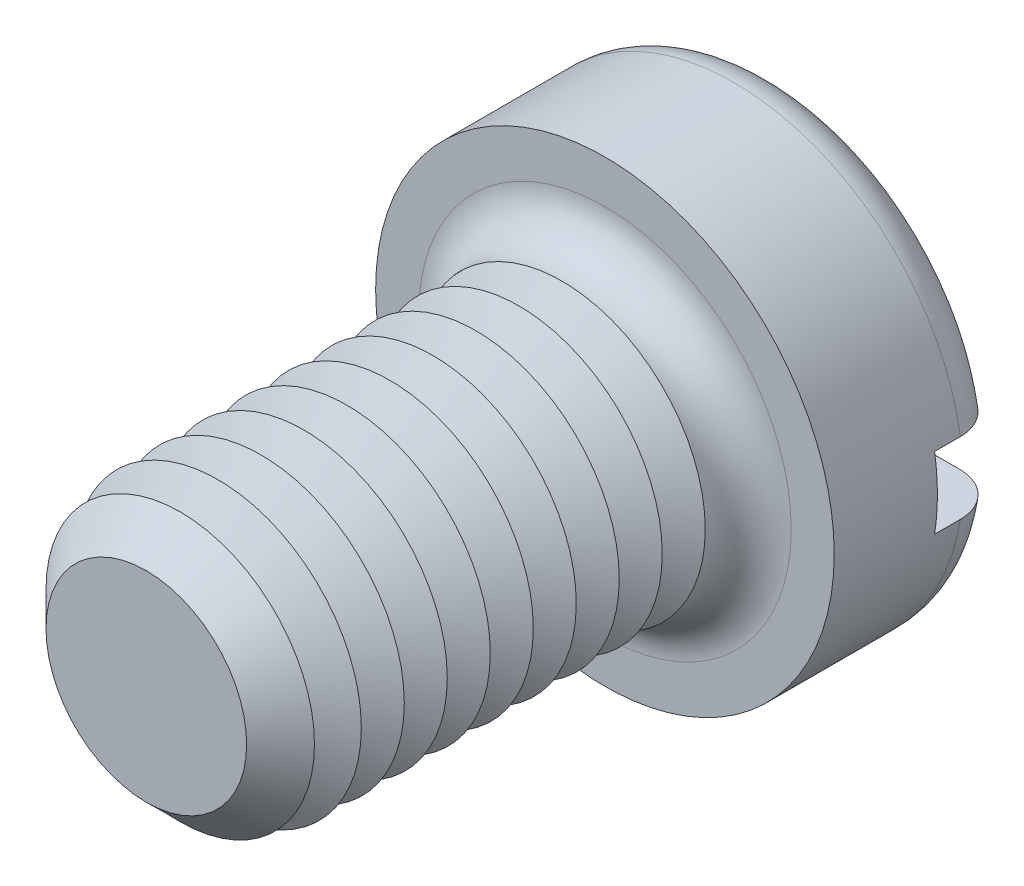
ISO-10303-21;
HEADER;
FILE_DESCRIPTION(('STEP AP214'),'2;1');
FILE_NAME('part.step','',(''),(''),'','','');
FILE_SCHEMA(('AUTOMOTIVE_DESIGN { 1 0 10303 214 1 1 1 1 }'));
ENDSEC;
DATA;
#1=APPLICATION_CONTEXT('core data for automotive mechanical design processes');
#2=APPLICATION_PROTOCOL_DEFINITION('international standard','automotive_design',2000,#1);
#3=PRODUCT_CONTEXT('',#1,'mechanical');
#4=PRODUCT('Part','Part','',(#3));
#5=PRODUCT_RELATED_PRODUCT_CATEGORY('part','',(#4));
#6=PRODUCT_DEFINITION_FORMATION('','',#4);
#7=PRODUCT_DEFINITION_CONTEXT('part definition',#1,'design');
#8=PRODUCT_DEFINITION('design','',#6,#7);
#9=PRODUCT_DEFINITION_SHAPE('','',#8);
#10=(LENGTH_UNIT() NAMED_UNIT(*) SI_UNIT(.MILLI.,.METRE.));
#11=(NAMED_UNIT(*) PLANE_ANGLE_UNIT() SI_UNIT($,.RADIAN.));
#12=(NAMED_UNIT(*) SI_UNIT($,.STERADIAN.) SOLID_ANGLE_UNIT());
#13=UNCERTAINTY_MEASURE_WITH_UNIT(LENGTH_MEASURE(1.E-05),#10,'distance_accuracy_value','');
#14=(GEOMETRIC_REPRESENTATION_CONTEXT(3) GLOBAL_UNCERTAINTY_ASSIGNED_CONTEXT((#13)) GLOBAL_UNIT_ASSIGNED_CONTEXT((#10,
#11,#12)) REPRESENTATION_CONTEXT('',''));
#15=CARTESIAN_POINT('',(0.,0.,0.));
#16=DIRECTION('',(0.,0.,1.));
#17=DIRECTION('',(1.,0.,0.));
#18=AXIS2_PLACEMENT_3D('',#15,#16,#17);
#19=CARTESIAN_POINT('',(0.,0.,-6.));
#20=DIRECTION('',(0.,0.,1.));
#21=DIRECTION('',(1.,0.,0.));
#22=AXIS2_PLACEMENT_3D('',#19,#20,#21);
#23=PLANE('',#22);
#24=CARTESIAN_POINT('',(0.,0.,-6.));
#25=DIRECTION('',(0.,0.,1.));
#26=DIRECTION('',(1.,0.,0.));
#27=AXIS2_PLACEMENT_3D('',#24,#25,#26);
#28=CIRCLE('',#27,6.5);
#29=CARTESIAN_POINT('',(-6.37867541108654,1.25,-6.));
#30=VERTEX_POINT('',#29);
#31=CARTESIAN_POINT('',(6.37867541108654,1.25,-6.));
#32=VERTEX_POINT('',#31);
#33=EDGE_CURVE('E116',#30,#32,#28,.F.);
#34=ORIENTED_EDGE('',*,*,#33,.T.);
#35=DIRECTION('',(1.,0.,0.));
#36=VECTOR('',#35,1.);
#37=CARTESIAN_POINT('',(-8.,1.25,-6.));
#38=LINE('',#37,#36);
#39=EDGE_CURVE('E111',#30,#32,#38,.T.);
#40=ORIENTED_EDGE('',*,*,#39,.F.);
#41=EDGE_LOOP('',(#34,#40));
#42=FACE_BOUND('',#41,.T.);
#43=ADVANCED_FACE('F39',(#42),#23,.F.);
#44=CARTESIAN_POINT('',(0.,0.,-4.5));
#45=DIRECTION('',(0.,0.,1.));
#46=DIRECTION('',(1.,0.,0.));
#47=AXIS2_PLACEMENT_3D('',#44,#45,#46);
#48=TOROIDAL_SURFACE('',#47,6.5,1.5);
#49=CARTESIAN_POINT('',(-7.63778128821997,1.25,-5.34492908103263));
#50=CARTESIAN_POINT('',(-7.58949199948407,1.25,-5.41482553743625));
#51=CARTESIAN_POINT('',(-7.53520056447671,1.25,-5.48065698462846));
#52=CARTESIAN_POINT('',(-7.41624971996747,1.25,-5.60228223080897));
#53=CARTESIAN_POINT('',(-7.35157642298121,1.25,-5.65806236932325));
#54=CARTESIAN_POINT('',(-7.21387612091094,1.25,-5.75795436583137));
#55=CARTESIAN_POINT('',(-7.14085828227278,1.25,-5.80207885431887));
#56=CARTESIAN_POINT('',(-6.98853766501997,1.25,-5.87758013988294));
#57=CARTESIAN_POINT('',(-6.90923642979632,1.25,-5.90896005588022));
#58=CARTESIAN_POINT('',(-6.74565677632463,1.25,-5.95849861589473));
#59=CARTESIAN_POINT('',(-6.66133328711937,1.25,-5.97650838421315));
#60=CARTESIAN_POINT('',(-6.49086565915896,1.25,-5.99833509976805));
#61=CARTESIAN_POINT('',(-6.40472129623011,1.25,-6.00215028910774));
#62=CARTESIAN_POINT('',(-6.23174891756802,1.25,-5.99550457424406));
#63=CARTESIAN_POINT('',(-6.14492874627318,1.25,-5.98483870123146));
#64=CARTESIAN_POINT('',(-5.97427268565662,1.25,-5.94920077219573));
#65=CARTESIAN_POINT('',(-5.89043699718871,1.25,-5.92422775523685));
#66=CARTESIAN_POINT('',(-5.72747580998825,1.25,-5.86041051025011));
#67=CARTESIAN_POINT('',(-5.64839123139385,1.25,-5.8214616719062));
#68=CARTESIAN_POINT('',(-5.49793182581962,1.25,-5.73076137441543));
#69=CARTESIAN_POINT('',(-5.42655700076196,1.25,-5.6790099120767));
#70=CARTESIAN_POINT('',(-5.29410028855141,1.25,-5.56444713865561));
#71=CARTESIAN_POINT('',(-5.23295591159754,1.25,-5.50170815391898));
#72=CARTESIAN_POINT('',(-5.12236155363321,1.25,-5.36664720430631));
#73=CARTESIAN_POINT('',(-5.07291010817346,1.25,-5.29432644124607));
#74=CARTESIAN_POINT('',(-4.98836421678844,1.25,-5.14389152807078));
#75=CARTESIAN_POINT('',(-4.95296843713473,1.25,-5.0659468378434));
#76=CARTESIAN_POINT('',(-4.89620356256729,1.25,-4.90510804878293));
#77=CARTESIAN_POINT('',(-4.87483169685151,1.25,-4.82221493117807));
#78=CARTESIAN_POINT('',(-4.8472995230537,1.25,-4.65636387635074));
#79=CARTESIAN_POINT('',(-4.84072446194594,1.25,-4.57347463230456));
#80=CARTESIAN_POINT('',(-4.84179430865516,1.25,-4.40779255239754));
#81=CARTESIAN_POINT('',(-4.84943782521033,1.25,-4.32499970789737));
#82=CARTESIAN_POINT('',(-4.87846819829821,1.25,-4.16301415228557));
#83=CARTESIAN_POINT('',(-4.89966978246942,1.25,-4.08378809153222));
#84=CARTESIAN_POINT('',(-4.95491528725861,1.25,-3.92995334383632));
#85=CARTESIAN_POINT('',(-4.98895983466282,1.25,-3.85534488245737));
#86=CARTESIAN_POINT('',(-5.06928242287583,1.25,-3.71183790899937));
#87=CARTESIAN_POINT('',(-5.11570495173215,1.25,-3.64302036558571));
#88=CARTESIAN_POINT('',(-5.21915370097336,1.25,-3.51388372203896));
#89=CARTESIAN_POINT('',(-5.27618132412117,1.25,-3.45356574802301));
#90=CARTESIAN_POINT('',(-5.40090076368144,1.25,-3.34137671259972));
#91=CARTESIAN_POINT('',(-5.46884305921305,1.25,-3.28978408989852));
#92=CARTESIAN_POINT('',(-5.61225757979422,1.25,-3.19841811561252));
#93=CARTESIAN_POINT('',(-5.68773079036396,1.25,-3.15864631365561));
#94=CARTESIAN_POINT('',(-5.84602026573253,1.25,-3.09111626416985));
#95=CARTESIAN_POINT('',(-5.92896901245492,1.25,-3.06366820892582));
#96=CARTESIAN_POINT('',(-6.09827849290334,1.25,-3.02294686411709));
#97=CARTESIAN_POINT('',(-6.18463944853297,1.25,-3.00967449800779));
#98=CARTESIAN_POINT('',(-6.35914138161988,1.25,-2.99765063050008));
#99=CARTESIAN_POINT('',(-6.4472913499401,1.25,-2.99902877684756));
#100=CARTESIAN_POINT('',(-6.62209547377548,1.25,-3.01665363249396));
#101=CARTESIAN_POINT('',(-6.70874965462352,1.25,-3.03290008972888));
#102=CARTESIAN_POINT('',(-6.87754008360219,1.25,-3.07975247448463));
#103=CARTESIAN_POINT('',(-6.95969991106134,1.25,-3.11027336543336));
#104=CARTESIAN_POINT('',(-7.11762200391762,1.25,-3.18486653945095));
#105=CARTESIAN_POINT('',(-7.19338469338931,1.25,-3.22893792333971));
#106=CARTESIAN_POINT('',(-7.33522754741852,1.25,-3.32873457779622));
#107=CARTESIAN_POINT('',(-7.40142768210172,1.25,-3.38428930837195));
#108=CARTESIAN_POINT('',(-7.52338344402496,1.25,-3.50587739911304));
#109=CARTESIAN_POINT('',(-7.5791399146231,1.25,-3.57190991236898));
#110=CARTESIAN_POINT('',(-7.67774856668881,1.25,-3.71151097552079));
#111=CARTESIAN_POINT('',(-7.72078137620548,1.25,-3.7849519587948));
#112=CARTESIAN_POINT('',(-7.79373860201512,1.25,-3.93807617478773));
#113=CARTESIAN_POINT('',(-7.82366445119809,1.25,-4.01775872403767));
#114=CARTESIAN_POINT('',(-7.86922494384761,1.25,-4.1801114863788));
#115=CARTESIAN_POINT('',(-7.88502105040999,1.25,-4.26273642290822));
#116=CARTESIAN_POINT('',(-7.90243332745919,1.25,-4.42948977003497));
#117=CARTESIAN_POINT('',(-7.90404643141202,1.25,-4.51361850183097));
#118=CARTESIAN_POINT('',(-7.89306914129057,1.25,-4.68049925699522));
#119=CARTESIAN_POINT('',(-7.88055163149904,1.25,-4.76325613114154));
#120=CARTESIAN_POINT('',(-7.84181179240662,1.25,-4.92542124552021));
#121=CARTESIAN_POINT('',(-7.81560657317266,1.25,-5.00483353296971));
#122=CARTESIAN_POINT('',(-7.76329893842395,1.25,-5.12766777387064));
#123=CARTESIAN_POINT('',(-7.74127773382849,1.25,-5.17287245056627));
#124=CARTESIAN_POINT('',(-7.69279783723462,1.25,-5.26083500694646));
#125=CARTESIAN_POINT('',(-7.66633917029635,1.25,-5.30359290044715));
#126=CARTESIAN_POINT('',(-7.63778128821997,1.25,-5.34492908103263));
#127=B_SPLINE_CURVE_WITH_KNOTS('',3,(#49,#50,#51,#52,#53,#54,#55,#56,#57,#58,#59,#60,#61,#62,
#63,#64,#65,#66,#67,#68,#69,#70,#71,#72,#73,#74,#75,#76,#77,#78,#79,#80,#81,#82,#83,#84,#85,#86,
#87,#88,#89,#90,#91,#92,#93,#94,#95,#96,#97,#98,#99,#100,#101,#102,#103,#104,#105,#106,#107,
#108,#109,#110,#111,#112,#113,#114,#115,#116,#117,#118,#119,#120,#121,#122,#123,#124,#125,#126),
.UNSPECIFIED.,.T.,.F.,(4,2,2,2,2,2,2,2,2,2,2,2,2,2,2,2,2,2,2,2,2,2,2,2,2,2,2,2,2,2,2,2,2,2,2,2,
2,2,4),(0.,0.254678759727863,0.509701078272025,0.764445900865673,1.01912834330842,
1.27660578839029,1.53411511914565,1.7953075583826,2.05651754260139,2.31972495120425,
2.58293242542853,2.84446831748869,3.10597143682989,3.36151874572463,3.61701554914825,
3.86525656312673,4.11347328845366,4.35836855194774,4.60327576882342,4.8511774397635,
5.0991119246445,5.35387584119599,5.60867314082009,5.86956650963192,6.13047687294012,
6.39369803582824,6.65691473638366,6.91858297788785,7.18023385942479,7.43824706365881,
7.69623942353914,7.95037087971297,8.20447454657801,8.45563599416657,8.70685174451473,
8.95677764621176,9.20639187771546,9.35700761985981,9.50762251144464),.UNSPECIFIED.);
#128=CARTESIAN_POINT('',(-7.90174031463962,1.25,-4.50000000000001));
#129=VERTEX_POINT('',#128);
#130=EDGE_CURVE('E257',#129,#30,#127,.T.);
#131=ORIENTED_EDGE('',*,*,#130,.F.);
#132=CARTESIAN_POINT('',(0.,0.,-4.5));
#133=DIRECTION('',(0.,0.,1.));
#134=DIRECTION('',(1.,0.,0.));
#135=AXIS2_PLACEMENT_3D('',#132,#133,#134);
#136=CIRCLE('',#135,8.);
#137=CARTESIAN_POINT('',(7.90174031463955,1.25,-4.5));
#138=VERTEX_POINT('',#137);
#139=EDGE_CURVE('E125',#138,#129,#136,.T.);
#140=ORIENTED_EDGE('',*,*,#139,.F.);
#141=CARTESIAN_POINT('',(4.95236709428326,1.25,-5.05808354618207));
#142=CARTESIAN_POINT('',(4.98477386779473,1.25,-5.13646278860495));
#143=CARTESIAN_POINT('',(5.02397623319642,1.25,-5.21210974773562));
#144=CARTESIAN_POINT('',(5.11464829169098,1.25,-5.35575180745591));
#145=CARTESIAN_POINT('',(5.16613670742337,1.25,-5.42373499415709));
#146=CARTESIAN_POINT('',(5.27963080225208,1.25,-5.55005899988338));
#147=CARTESIAN_POINT('',(5.34161871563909,1.25,-5.60841578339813));
#148=CARTESIAN_POINT('',(5.47431803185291,1.25,-5.71412381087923));
#149=CARTESIAN_POINT('',(5.545027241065,1.25,-5.76147781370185));
#150=CARTESIAN_POINT('',(5.69469818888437,1.25,-5.84486022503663));
#151=CARTESIAN_POINT('',(5.77379661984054,1.25,-5.88064336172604));
#152=CARTESIAN_POINT('',(5.93682776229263,1.25,-5.93863952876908));
#153=CARTESIAN_POINT('',(6.02076112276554,1.25,-5.96085073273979));
#154=CARTESIAN_POINT('',(6.19235911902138,1.25,-5.99130732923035));
#155=CARTESIAN_POINT('',(6.2800597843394,1.25,-5.99935025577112));
#156=CARTESIAN_POINT('',(6.45556807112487,1.25,-6.00057400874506));
#157=CARTESIAN_POINT('',(6.5433756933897,1.25,-5.99375472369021));
#158=CARTESIAN_POINT('',(6.71642471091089,1.25,-5.96539034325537));
#159=CARTESIAN_POINT('',(6.80167037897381,1.25,-5.94387137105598));
#160=CARTESIAN_POINT('',(6.96726399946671,1.25,-5.8866508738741));
#161=CARTESIAN_POINT('',(7.04761223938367,1.25,-5.85095018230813));
#162=CARTESIAN_POINT('',(7.2000703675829,1.25,-5.7668235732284));
#163=CARTESIAN_POINT('',(7.27226868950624,1.25,-5.71855796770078));
#164=CARTESIAN_POINT('',(7.40737382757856,1.25,-5.61041520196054));
#165=CARTESIAN_POINT('',(7.47028138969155,1.25,-5.55053897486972));
#166=CARTESIAN_POINT('',(7.5840004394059,1.25,-5.42185995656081));
#167=CARTESIAN_POINT('',(7.63498189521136,1.25,-5.35320736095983));
#168=CARTESIAN_POINT('',(7.72451646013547,1.25,-5.20822613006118));
#169=CARTESIAN_POINT('',(7.76307051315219,1.25,-5.13189807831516));
#170=CARTESIAN_POINT('',(7.82615156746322,1.25,-4.97479919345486));
#171=CARTESIAN_POINT('',(7.85085353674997,1.25,-4.89409858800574));
#172=CARTESIAN_POINT('',(7.88624162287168,1.25,-4.72968126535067));
#173=CARTESIAN_POINT('',(7.89692844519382,1.25,-4.64596470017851));
#174=CARTESIAN_POINT('',(7.90393395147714,1.25,-4.47857496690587));
#175=CARTESIAN_POINT('',(7.900361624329,1.25,-4.39490633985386));
#176=CARTESIAN_POINT('',(7.8792027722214,1.25,-4.2293620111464));
#177=CARTESIAN_POINT('',(7.86161649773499,1.25,-4.14748627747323));
#178=CARTESIAN_POINT('',(7.81298565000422,1.25,-3.98793539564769));
#179=CARTESIAN_POINT('',(7.78195585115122,1.25,-3.91025574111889));
#180=CARTESIAN_POINT('',(7.70736418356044,1.25,-3.76116938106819));
#181=CARTESIAN_POINT('',(7.66380211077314,1.25,-3.68976277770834));
#182=CARTESIAN_POINT('',(7.56515173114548,1.25,-3.55480889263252));
#183=CARTESIAN_POINT('',(7.51000119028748,1.25,-3.49130712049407));
#184=CARTESIAN_POINT('',(7.38992820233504,1.25,-3.3743390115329));
#185=CARTESIAN_POINT('',(7.32500529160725,1.25,-3.32087315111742));
#186=CARTESIAN_POINT('',(7.18646521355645,1.25,-3.22483712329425));
#187=CARTESIAN_POINT('',(7.11275872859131,1.25,-3.18239583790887));
#188=CARTESIAN_POINT('',(6.95934489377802,1.25,-3.11028530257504));
#189=CARTESIAN_POINT('',(6.87963710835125,1.25,-3.08061698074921));
#190=CARTESIAN_POINT('',(6.71523243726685,1.25,-3.03442872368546));
#191=CARTESIAN_POINT('',(6.63047940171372,1.25,-3.0181086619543));
#192=CARTESIAN_POINT('',(6.45944163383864,1.25,-2.99971307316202));
#193=CARTESIAN_POINT('',(6.37315677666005,1.25,-2.99763871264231));
#194=CARTESIAN_POINT('',(6.20021063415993,1.25,-3.00779604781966));
#195=CARTESIAN_POINT('',(6.11356117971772,1.25,-3.02022976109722));
#196=CARTESIAN_POINT('',(5.9435409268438,1.25,-3.0593597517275));
#197=CARTESIAN_POINT('',(5.86017035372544,1.25,-3.08605700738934));
#198=CARTESIAN_POINT('',(5.69848536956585,1.25,-3.15322746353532));
#199=CARTESIAN_POINT('',(5.62021039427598,1.25,-3.1937956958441));
#200=CARTESIAN_POINT('',(5.47164170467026,1.25,-3.28758816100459));
#201=CARTESIAN_POINT('',(5.40134797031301,1.25,-3.3408123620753));
#202=CARTESIAN_POINT('',(5.27136483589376,1.25,-3.45806317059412));
#203=CARTESIAN_POINT('',(5.21160120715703,1.25,-3.5220074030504));
#204=CARTESIAN_POINT('',(5.10396941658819,1.25,-3.65922833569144));
#205=CARTESIAN_POINT('',(5.05609917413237,1.25,-3.73250340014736));
#206=CARTESIAN_POINT('',(4.97487058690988,1.25,-3.8844714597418));
#207=CARTESIAN_POINT('',(4.94119529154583,1.25,-3.96299495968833));
#208=CARTESIAN_POINT('',(4.88793322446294,1.25,-4.12470694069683));
#209=CARTESIAN_POINT('',(4.86834741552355,1.25,-4.20789574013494));
#210=CARTESIAN_POINT('',(4.84433446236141,1.25,-4.3740749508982));
#211=CARTESIAN_POINT('',(4.83950391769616,1.25,-4.45700748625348));
#212=CARTESIAN_POINT('',(4.84404021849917,1.25,-4.62240731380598));
#213=CARTESIAN_POINT('',(4.85338770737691,1.25,-4.70487508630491));
#214=CARTESIAN_POINT('',(4.87895619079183,1.25,-4.83246978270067));
#215=CARTESIAN_POINT('',(4.89056704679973,1.25,-4.87856970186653));
#216=CARTESIAN_POINT('',(4.91819711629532,1.25,-4.96942661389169));
#217=CARTESIAN_POINT('',(4.93421619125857,1.25,-5.01418364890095));
#218=CARTESIAN_POINT('',(4.95236709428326,1.25,-5.05808354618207));
#219=B_SPLINE_CURVE_WITH_KNOTS('',3,(#141,#142,#143,#144,#145,#146,#147,#148,#149,#150,#151,
#152,#153,#154,#155,#156,#157,#158,#159,#160,#161,#162,#163,#164,#165,#166,#167,#168,#169,#170,
#171,#172,#173,#174,#175,#176,#177,#178,#179,#180,#181,#182,#183,#184,#185,#186,#187,#188,#189,
#190,#191,#192,#193,#194,#195,#196,#197,#198,#199,#200,#201,#202,#203,#204,#205,#206,#207,#208,
#209,#210,#211,#212,#213,#214,#215,#216,#217,#218),.UNSPECIFIED.,.T.,.F.,(4,2,2,2,2,2,2,2,2,2,2,
2,2,2,2,2,2,2,2,2,2,2,2,2,2,2,2,2,2,2,2,2,2,2,2,2,2,2,4),(0.,0.254263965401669,
0.508917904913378,0.763145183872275,1.01730864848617,1.27655188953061,1.53583000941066,
1.79878406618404,2.06174009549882,2.32423003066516,2.5867045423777,2.84598168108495,
3.10523799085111,3.36053725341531,3.61581712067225,3.86779535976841,4.11976091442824,
4.36980428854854,4.61984319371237,4.86960800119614,5.11937687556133,5.3705230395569,
5.62168112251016,5.87565515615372,6.12964764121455,6.38737709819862,6.64512765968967,
6.90651052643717,7.16791132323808,7.43114013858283,7.69436829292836,7.95565940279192,
8.21690477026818,8.47196060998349,8.72703387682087,8.97506819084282,9.22276418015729,
9.36518087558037,9.50759309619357),.UNSPECIFIED.);
#220=EDGE_CURVE('E259',#32,#138,#219,.T.);
#221=ORIENTED_EDGE('',*,*,#220,.F.);
#222=ORIENTED_EDGE('',*,*,#33,.F.);
#223=EDGE_LOOP('',(#131,#140,#221,#222));
#224=FACE_BOUND('',#223,.T.);
#225=ADVANCED_FACE('F241',(#224),#48,.T.);
#226=CARTESIAN_POINT('',(0.,0.,-6.));
#227=DIRECTION('',(0.,0.,1.));
#228=DIRECTION('',(1.,0.,0.));
#229=AXIS2_PLACEMENT_3D('',#226,#227,#228);
#230=CYLINDRICAL_SURFACE('',#229,8.);
#231=DIRECTION('',(0.,0.,1.));
#232=VECTOR('',#231,1.);
#233=CARTESIAN_POINT('',(7.90174031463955,1.25,-6.));
#234=LINE('',#233,#232);
#235=CARTESIAN_POINT('',(7.90174031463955,1.25,-3.6));
#236=VERTEX_POINT('',#235);
#237=EDGE_CURVE('E272',#138,#236,#234,.T.);
#238=ORIENTED_EDGE('',*,*,#237,.F.);
#239=ORIENTED_EDGE('',*,*,#139,.T.);
#240=DIRECTION('',(0.,0.,1.));
#241=VECTOR('',#240,1.);
#242=CARTESIAN_POINT('',(-7.90174031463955,1.25,-6.));
#243=LINE('',#242,#241);
#244=CARTESIAN_POINT('',(-7.90174031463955,1.25,-3.6));
#245=VERTEX_POINT('',#244);
#246=EDGE_CURVE('E63',#245,#129,#243,.F.);
#247=ORIENTED_EDGE('',*,*,#246,.F.);
#248=CARTESIAN_POINT('',(0.,0.,-3.6));
#249=DIRECTION('',(0.,0.,-1.));
#250=DIRECTION('',(-1.,0.,0.));
#251=AXIS2_PLACEMENT_3D('',#248,#249,#250);
#252=CIRCLE('',#251,8.);
#253=CARTESIAN_POINT('',(-7.90174031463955,-1.25,-3.6));
#254=VERTEX_POINT('',#253);
#255=EDGE_CURVE('E43',#245,#254,#252,.F.);
#256=ORIENTED_EDGE('',*,*,#255,.T.);
#257=DIRECTION('',(0.,0.,1.));
#258=VECTOR('',#257,1.);
#259=CARTESIAN_POINT('',(-7.90174031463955,-1.25,-6.));
#260=LINE('',#259,#258);
#261=CARTESIAN_POINT('',(-7.9017403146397,-1.25,-4.49999999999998));
#262=VERTEX_POINT('',#261);
#263=EDGE_CURVE('E269',#262,#254,#260,.T.);
#264=ORIENTED_EDGE('',*,*,#263,.F.);
#265=CARTESIAN_POINT('',(7.90174031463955,-1.25,-4.5));
#266=VERTEX_POINT('',#265);
#267=EDGE_CURVE('E127',#262,#266,#136,.T.);
#268=ORIENTED_EDGE('',*,*,#267,.T.);
#269=DIRECTION('',(0.,0.,1.));
#270=VECTOR('',#269,1.);
#271=CARTESIAN_POINT('',(7.90174031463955,-1.25,-6.));
#272=LINE('',#271,#270);
#273=CARTESIAN_POINT('',(7.90174031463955,-1.25,-3.6));
#274=VERTEX_POINT('',#273);
#275=EDGE_CURVE('E55',#274,#266,#272,.F.);
#276=ORIENTED_EDGE('',*,*,#275,.F.);
#277=EDGE_CURVE('E11',#274,#236,#252,.F.);
#278=ORIENTED_EDGE('',*,*,#277,.T.);
#279=EDGE_LOOP('',(#238,#239,#247,#256,#264,#268,#276,#278));
#280=FACE_BOUND('',#279,.T.);
#281=CARTESIAN_POINT('',(0.,0.,0.));
#282=DIRECTION('',(0.,0.,1.));
#283=DIRECTION('',(1.,0.,0.));
#284=AXIS2_PLACEMENT_3D('',#281,#282,#283);
#285=CIRCLE('',#284,8.);
#286=CARTESIAN_POINT('',(8.,0.,0.));
#287=VERTEX_POINT('',#286);
#288=EDGE_CURVE('E275',#287,#287,#285,.T.);
#289=ORIENTED_EDGE('',*,*,#288,.F.);
#290=EDGE_LOOP('',(#289));
#291=FACE_BOUND('',#290,.T.);
#292=ADVANCED_FACE('F237',(#280,#291),#230,.T.);
#293=CARTESIAN_POINT('',(6.37867541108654,-1.25,-6.));
#294=VERTEX_POINT('',#293);
#295=CARTESIAN_POINT('',(-6.37867541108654,-1.25,-6.));
#296=VERTEX_POINT('',#295);
#297=EDGE_CURVE('E109',#294,#296,#28,.F.);
#298=ORIENTED_EDGE('',*,*,#297,.T.);
#299=DIRECTION('',(-1.,0.,0.));
#300=VECTOR('',#299,1.);
#301=CARTESIAN_POINT('',(-8.,-1.25,-6.));
#302=LINE('',#301,#300);
#303=EDGE_CURVE('E96',#294,#296,#302,.T.);
#304=ORIENTED_EDGE('',*,*,#303,.F.);
#305=EDGE_LOOP('',(#298,#304));
#306=FACE_BOUND('',#305,.T.);
#307=ADVANCED_FACE('F108',(#306),#23,.F.);
#308=CARTESIAN_POINT('',(0.,0.,0.));
#309=DIRECTION('',(0.,0.,1.));
#310=DIRECTION('',(1.,0.,0.));
#311=AXIS2_PLACEMENT_3D('',#308,#309,#310);
#312=PLANE('',#311);
#313=CARTESIAN_POINT('',(0.,0.,0.));
#314=DIRECTION('',(0.,0.,1.));
#315=DIRECTION('',(1.,0.,0.));
#316=AXIS2_PLACEMENT_3D('',#313,#314,#315);
#317=CIRCLE('',#316,6.5);
#318=CARTESIAN_POINT('',(6.5,0.,0.));
#319=VERTEX_POINT('',#318);
#320=EDGE_CURVE('E115',#319,#319,#317,.F.);
#321=ORIENTED_EDGE('',*,*,#320,.T.);
#322=EDGE_LOOP('',(#321));
#323=FACE_BOUND('',#322,.T.);
#324=ORIENTED_EDGE('',*,*,#288,.T.);
#325=EDGE_LOOP('',(#324));
#326=FACE_BOUND('',#325,.T.);
#327=ADVANCED_FACE('F236',(#323,#326),#312,.T.);
#328=CARTESIAN_POINT('',(-7.63778128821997,-1.25,-5.34492908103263));
#329=CARTESIAN_POINT('',(-7.68527581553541,-1.25,-5.27616964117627));
#330=CARTESIAN_POINT('',(-7.72703224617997,-1.25,-5.20337764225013));
#331=CARTESIAN_POINT('',(-7.79778035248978,-1.25,-5.05176511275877));
#332=CARTESIAN_POINT('',(-7.82675823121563,-1.25,-4.97293817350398));
#333=CARTESIAN_POINT('',(-7.87103239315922,-1.25,-4.81153865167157));
#334=CARTESIAN_POINT('',(-7.8863313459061,-1.25,-4.72896680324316));
#335=CARTESIAN_POINT('',(-7.90278562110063,-1.25,-4.56244566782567));
#336=CARTESIAN_POINT('',(-7.90394420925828,-1.25,-4.4784967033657));
#337=CARTESIAN_POINT('',(-7.89211470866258,-1.25,-4.31190980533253));
#338=CARTESIAN_POINT('',(-7.87917806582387,-1.25,-4.22926821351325));
#339=CARTESIAN_POINT('',(-7.8396278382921,-1.25,-4.06732477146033));
#340=CARTESIAN_POINT('',(-7.81301388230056,-1.25,-3.98802301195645));
#341=CARTESIAN_POINT('',(-7.74686575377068,-1.25,-3.83490116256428));
#342=CARTESIAN_POINT('',(-7.70731700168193,-1.25,-3.76108737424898));
#343=CARTESIAN_POINT('',(-7.61647675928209,-1.25,-3.62108231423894));
#344=CARTESIAN_POINT('',(-7.56518496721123,-1.25,-3.55489123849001));
#345=CARTESIAN_POINT('',(-7.45192141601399,-1.25,-3.43145488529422));
#346=CARTESIAN_POINT('',(-7.3898717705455,-1.25,-3.37428109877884));
#347=CARTESIAN_POINT('',(-7.25715883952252,-1.25,-3.27100737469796));
#348=CARTESIAN_POINT('',(-7.18649507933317,-1.25,-3.22490804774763));
#349=CARTESIAN_POINT('',(-7.03760898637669,-1.25,-3.14445316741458));
#350=CARTESIAN_POINT('',(-6.95930204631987,-1.25,-3.1102542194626));
#351=CARTESIAN_POINT('',(-6.79811453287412,-1.25,-3.05526915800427));
#352=CARTESIAN_POINT('',(-6.71523359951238,-1.25,-3.03448410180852));
#353=CARTESIAN_POINT('',(-6.5459165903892,-1.25,-3.006592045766));
#354=CARTESIAN_POINT('',(-6.45944575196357,-1.25,-2.99969602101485));
#355=CARTESIAN_POINT('',(-6.28655568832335,-1.25,-3.00032465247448));
#356=CARTESIAN_POINT('',(-6.20013646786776,-1.25,-3.00785047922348));
#357=CARTESIAN_POINT('',(-6.02865505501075,-1.25,-3.03725742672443));
#358=CARTESIAN_POINT('',(-5.94362352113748,-1.25,-3.05931758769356));
#359=CARTESIAN_POINT('',(-5.77844448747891,-1.25,-3.11735373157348));
#360=CARTESIAN_POINT('',(-5.69829723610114,-1.25,-3.15333042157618));
#361=CARTESIAN_POINT('',(-5.54495924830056,-1.25,-3.23837037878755));
#362=CARTESIAN_POINT('',(-5.47178958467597,-1.25,-3.28747168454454));
#363=CARTESIAN_POINT('',(-5.33486536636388,-1.25,-3.39741183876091));
#364=CARTESIAN_POINT('',(-5.27111040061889,-1.25,-3.45825017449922));
#365=CARTESIAN_POINT('',(-5.15579778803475,-1.25,-3.5891472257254));
#366=CARTESIAN_POINT('',(-5.10409113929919,-1.25,-3.65907455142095));
#367=CARTESIAN_POINT('',(-5.01353659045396,-1.25,-3.8068142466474));
#368=CARTESIAN_POINT('',(-4.97468647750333,-1.25,-3.88462525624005));
#369=CARTESIAN_POINT('',(-4.91208858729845,-1.25,-4.04366636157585));
#370=CARTESIAN_POINT('',(-4.88795969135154,-1.25,-4.12474643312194));
#371=CARTESIAN_POINT('',(-4.85404909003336,-1.25,-4.28985038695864));
#372=CARTESIAN_POINT('',(-4.84426486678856,-1.25,-4.37387374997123));
#373=CARTESIAN_POINT('',(-4.83946276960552,-1.25,-4.54023897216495));
#374=CARTESIAN_POINT('',(-4.8440833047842,-1.25,-4.62257060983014));
#375=CARTESIAN_POINT('',(-4.86713763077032,-1.25,-4.78527148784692));
#376=CARTESIAN_POINT('',(-4.88557092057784,-1.25,-4.86564079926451));
#377=CARTESIAN_POINT('',(-4.9355229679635,-1.25,-5.02189555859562));
#378=CARTESIAN_POINT('',(-4.9669975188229,-1.25,-5.09779517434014));
#379=CARTESIAN_POINT('',(-5.04199393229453,-1.25,-5.24338322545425));
#380=CARTESIAN_POINT('',(-5.0855168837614,-1.25,-5.31307109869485));
#381=CARTESIAN_POINT('',(-5.1842754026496,-1.25,-5.44580979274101));
#382=CARTESIAN_POINT('',(-5.2397318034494,-1.25,-5.50869620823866));
#383=CARTESIAN_POINT('',(-5.36015301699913,-1.25,-5.62458635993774));
#384=CARTESIAN_POINT('',(-5.42511919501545,-1.25,-5.67758867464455));
#385=CARTESIAN_POINT('',(-5.56469412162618,-1.25,-5.7737610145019));
#386=CARTESIAN_POINT('',(-5.6395232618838,-1.25,-5.81661133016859));
#387=CARTESIAN_POINT('',(-5.79521544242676,-1.25,-5.8894110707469));
#388=CARTESIAN_POINT('',(-5.87607915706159,-1.25,-5.91935905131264));
#389=CARTESIAN_POINT('',(-6.04317815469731,-1.25,-5.9660059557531));
#390=CARTESIAN_POINT('',(-6.12948555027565,-1.25,-5.98244700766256));
#391=CARTESIAN_POINT('',(-6.30363462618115,-1.25,-6.00064866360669));
#392=CARTESIAN_POINT('',(-6.39147629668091,-1.25,-6.00240936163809));
#393=CARTESIAN_POINT('',(-6.5664192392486,-1.25,-5.9911248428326));
#394=CARTESIAN_POINT('',(-6.653518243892,-1.25,-5.9780442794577));
#395=CARTESIAN_POINT('',(-6.82426167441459,-1.25,-5.93729204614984));
#396=CARTESIAN_POINT('',(-6.90790538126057,-1.25,-5.90961735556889));
#397=CARTESIAN_POINT('',(-7.06846412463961,-1.25,-5.84071272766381));
#398=CARTESIAN_POINT('',(-7.14543542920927,-1.25,-5.79961377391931));
#399=CARTESIAN_POINT('',(-7.29116896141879,-1.25,-5.70491210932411));
#400=CARTESIAN_POINT('',(-7.35994165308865,-1.25,-5.65132560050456));
#401=CARTESIAN_POINT('',(-7.46362894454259,-1.25,-5.55509815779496));
#402=CARTESIAN_POINT('',(-7.50165191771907,-1.25,-5.51575032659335));
#403=CARTESIAN_POINT('',(-7.57319530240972,-1.25,-5.43315308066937));
#404=CARTESIAN_POINT('',(-7.60671575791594,-1.25,-5.38990370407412));
#405=CARTESIAN_POINT('',(-7.63778128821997,-1.25,-5.34492908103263));
#406=B_SPLINE_CURVE_WITH_KNOTS('',3,(#328,#329,#330,#331,#332,#333,#334,#335,#336,#337,#338,
#339,#340,#341,#342,#343,#344,#345,#346,#347,#348,#349,#350,#351,#352,#353,#354,#355,#356,#357,
#358,#359,#360,#361,#362,#363,#364,#365,#366,#367,#368,#369,#370,#371,#372,#373,#374,#375,#376,
#377,#378,#379,#380,#381,#382,#383,#384,#385,#386,#387,#388,#389,#390,#391,#392,#393,#394,#395,
#396,#397,#398,#399,#400,#401,#402,#403,#404,#405),.UNSPECIFIED.,.T.,.F.,(4,2,2,2,2,2,2,2,2,2,2,
2,2,2,2,2,2,2,2,2,2,2,2,2,2,2,2,2,2,2,2,2,2,2,2,2,2,2,4),(0.,0.250506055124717,
0.501281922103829,0.752008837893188,1.00267784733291,1.25243500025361,1.50219893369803,
1.75224536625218,2.00229822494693,2.25424343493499,2.50620253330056,2.76136198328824,
3.01654154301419,3.27556891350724,3.53461730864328,3.79691797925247,4.05923197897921,
4.32231463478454,4.5853858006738,4.84500678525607,5.10458306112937,5.3571172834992,
5.60960717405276,5.85581050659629,6.1020049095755,6.34737151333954,6.59276029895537,
6.84315522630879,7.09358613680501,7.35108485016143,7.60861238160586,7.87094926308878,
8.13328446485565,8.39624576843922,8.65926152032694,8.91978401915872,9.17997036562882,
9.34382460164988,9.50767723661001),.UNSPECIFIED.);
#407=EDGE_CURVE('E103',#296,#262,#406,.T.);
#408=ORIENTED_EDGE('',*,*,#407,.F.);
#409=ORIENTED_EDGE('',*,*,#297,.F.);
#410=CARTESIAN_POINT('',(4.95236709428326,-1.25,-5.05808354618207));
#411=CARTESIAN_POINT('',(4.92105512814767,-1.25,-4.98233216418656));
#412=CARTESIAN_POINT('',(4.89604361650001,-1.25,-4.90392040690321));
#413=CARTESIAN_POINT('',(4.85951223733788,-1.25,-4.74395758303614));
#414=CARTESIAN_POINT('',(4.8480045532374,-1.25,-4.66240375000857));
#415=CARTESIAN_POINT('',(4.83891469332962,-1.25,-4.49852199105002));
#416=CARTESIAN_POINT('',(4.84133145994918,-1.25,-4.41619412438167));
#417=CARTESIAN_POINT('',(4.8600038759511,-1.25,-4.25314313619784));
#418=CARTESIAN_POINT('',(4.87625705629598,-1.25,-4.17241973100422));
#419=CARTESIAN_POINT('',(4.92196554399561,-1.25,-4.01505032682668));
#420=CARTESIAN_POINT('',(4.95138456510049,-1.25,-3.93839376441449));
#421=CARTESIAN_POINT('',(5.02244158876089,-1.25,-3.79097367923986));
#422=CARTESIAN_POINT('',(5.06408092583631,-1.25,-3.72021080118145));
#423=CARTESIAN_POINT('',(5.15918188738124,-1.25,-3.5851203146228));
#424=CARTESIAN_POINT('',(5.21285223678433,-1.25,-3.5209397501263));
#425=CARTESIAN_POINT('',(5.32993512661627,-1.25,-3.40218700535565));
#426=CARTESIAN_POINT('',(5.39334903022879,-1.25,-3.34761617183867));
#427=CARTESIAN_POINT('',(5.5300552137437,-1.25,-3.24801679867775));
#428=CARTESIAN_POINT('',(5.60357647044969,-1.25,-3.20330242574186));
#429=CARTESIAN_POINT('',(5.75697062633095,-1.25,-3.1265687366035));
#430=CARTESIAN_POINT('',(5.83684424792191,-1.25,-3.09455086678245));
#431=CARTESIAN_POINT('',(6.00239031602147,-1.25,-3.04353393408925));
#432=CARTESIAN_POINT('',(6.08814636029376,-1.25,-3.02480570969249));
#433=CARTESIAN_POINT('',(6.26158564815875,-1.25,-3.00194915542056));
#434=CARTESIAN_POINT('',(6.34926896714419,-1.25,-2.997821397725));
#435=CARTESIAN_POINT('',(6.52441816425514,-1.25,-3.00435236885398));
#436=CARTESIAN_POINT('',(6.61188199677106,-1.25,-3.01506655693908));
#437=CARTESIAN_POINT('',(6.78373130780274,-1.25,-3.05116556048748));
#438=CARTESIAN_POINT('',(6.8681168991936,-1.25,-3.07654983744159));
#439=CARTESIAN_POINT('',(7.03056473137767,-1.25,-3.14105639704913));
#440=CARTESIAN_POINT('',(7.10867812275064,-1.25,-3.18004978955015));
#441=CARTESIAN_POINT('',(7.25711285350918,-1.25,-3.27078804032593));
#442=CARTESIAN_POINT('',(7.327434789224,-1.25,-3.32253192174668));
#443=CARTESIAN_POINT('',(7.45716954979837,-1.25,-3.4364775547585));
#444=CARTESIAN_POINT('',(7.51672925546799,-1.25,-3.49851206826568));
#445=CARTESIAN_POINT('',(7.62440498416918,-1.25,-3.63182557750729));
#446=CARTESIAN_POINT('',(7.67252193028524,-1.25,-3.70310382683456));
#447=CARTESIAN_POINT('',(7.75523498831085,-1.25,-3.8517825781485));
#448=CARTESIAN_POINT('',(7.79001407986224,-1.25,-3.92908131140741));
#449=CARTESIAN_POINT('',(7.84595474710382,-1.25,-4.08845836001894));
#450=CARTESIAN_POINT('',(7.86711715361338,-1.25,-4.1705363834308));
#451=CARTESIAN_POINT('',(7.89503817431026,-1.25,-4.33627683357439));
#452=CARTESIAN_POINT('',(7.90193595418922,-1.25,-4.41991584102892));
#453=CARTESIAN_POINT('',(7.90153623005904,-1.25,-4.58715860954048));
#454=CARTESIAN_POINT('',(7.89423915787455,-1.25,-4.67076237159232));
#455=CARTESIAN_POINT('',(7.86572271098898,-1.25,-4.83525080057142));
#456=CARTESIAN_POINT('',(7.84455307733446,-1.25,-4.91614410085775));
#457=CARTESIAN_POINT('',(7.78897430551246,-1.25,-5.0732444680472));
#458=CARTESIAN_POINT('',(7.75456511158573,-1.25,-5.1494515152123));
#459=CARTESIAN_POINT('',(7.67339923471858,-1.25,-5.29528903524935));
#460=CARTESIAN_POINT('',(7.62660424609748,-1.25,-5.36489817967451));
#461=CARTESIAN_POINT('',(7.52209201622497,-1.25,-5.49536318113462));
#462=CARTESIAN_POINT('',(7.4643743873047,-1.25,-5.55621872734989));
#463=CARTESIAN_POINT('',(7.33909994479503,-1.25,-5.66807257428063));
#464=CARTESIAN_POINT('',(7.27145672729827,-1.25,-5.71897407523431));
#465=CARTESIAN_POINT('',(7.12868060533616,-1.25,-5.80887807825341));
#466=CARTESIAN_POINT('',(7.0535472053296,-1.25,-5.84787979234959));
#467=CARTESIAN_POINT('',(6.89682225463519,-1.25,-5.91345911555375));
#468=CARTESIAN_POINT('',(6.81515596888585,-1.25,-5.93985808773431));
#469=CARTESIAN_POINT('',(6.64858434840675,-1.25,-5.97879449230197));
#470=CARTESIAN_POINT('',(6.56367874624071,-1.25,-5.99133077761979));
#471=CARTESIAN_POINT('',(6.39168259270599,-1.25,-6.00236627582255));
#472=CARTESIAN_POINT('',(6.30457835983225,-1.25,-6.00065255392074));
#473=CARTESIAN_POINT('',(6.13186422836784,-1.25,-5.98278857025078));
#474=CARTESIAN_POINT('',(6.04625438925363,-1.25,-5.96663773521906));
#475=CARTESIAN_POINT('',(5.87802521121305,-1.25,-5.92012173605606));
#476=CARTESIAN_POINT('',(5.79544617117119,-1.25,-5.88961066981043));
#477=CARTESIAN_POINT('',(5.63656223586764,-1.25,-5.81513349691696));
#478=CARTESIAN_POINT('',(5.56025908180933,-1.25,-5.77116367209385));
#479=CARTESIAN_POINT('',(5.4162607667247,-1.25,-5.67098882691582));
#480=CARTESIAN_POINT('',(5.34855795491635,-1.25,-5.61479480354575));
#481=CARTESIAN_POINT('',(5.22382615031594,-1.25,-5.49168804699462));
#482=CARTESIAN_POINT('',(5.16678340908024,-1.25,-5.42478932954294));
#483=CARTESIAN_POINT('',(5.08326589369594,-1.25,-5.3075481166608));
#484=CARTESIAN_POINT('',(5.05313168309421,-1.25,-5.25976959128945));
#485=CARTESIAN_POINT('',(4.99845900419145,-1.25,-5.16110869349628));
#486=CARTESIAN_POINT('',(4.9739204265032,-1.25,-5.11022638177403));
#487=CARTESIAN_POINT('',(4.95236709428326,-1.25,-5.05808354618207));
#488=B_SPLINE_CURVE_WITH_KNOTS('',3,(#410,#411,#412,#413,#414,#415,#416,#417,#418,#419,#420,
#421,#422,#423,#424,#425,#426,#427,#428,#429,#430,#431,#432,#433,#434,#435,#436,#437,#438,#439,
#440,#441,#442,#443,#444,#445,#446,#447,#448,#449,#450,#451,#452,#453,#454,#455,#456,#457,#458,
#459,#460,#461,#462,#463,#464,#465,#466,#467,#468,#469,#470,#471,#472,#473,#474,#475,#476,#477,
#478,#479,#480,#481,#482,#483,#484,#485,#486,#487),.UNSPECIFIED.,.T.,.F.,(4,2,2,2,2,2,2,2,2,2,2,
2,2,2,2,2,2,2,2,2,2,2,2,2,2,2,2,2,2,2,2,2,2,2,2,2,2,2,4),(0.,0.245701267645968,
0.491624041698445,0.737528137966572,0.983388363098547,1.22857510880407,1.47378864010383,
1.72364048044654,1.97352730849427,2.2304941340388,2.48749022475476,2.74958408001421,
3.01168820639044,3.27477437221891,3.53785088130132,3.79850056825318,4.05913029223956,
4.31587819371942,4.57260537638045,4.82567253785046,5.07872425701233,5.32929532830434,
5.57985877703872,5.8295286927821,6.07919966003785,6.32965199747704,6.58011322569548,
6.8329006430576,7.08570479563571,7.3419930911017,7.59830259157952,7.85844887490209,
8.11860548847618,8.38146435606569,8.64439590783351,8.90709189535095,9.16944670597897,
9.33857644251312,9.5077028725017),.UNSPECIFIED.);
#489=EDGE_CURVE('E92',#266,#294,#488,.T.);
#490=ORIENTED_EDGE('',*,*,#489,.F.);
#491=ORIENTED_EDGE('',*,*,#267,.F.);
#492=EDGE_LOOP('',(#408,#409,#490,#491));
#493=FACE_BOUND('',#492,.T.);
#494=ADVANCED_FACE('F113',(#493),#48,.T.);
#495=CARTESIAN_POINT('',(0.,0.,1.5));
#496=DIRECTION('',(0.,0.,1.));
#497=DIRECTION('',(1.,0.,0.));
#498=AXIS2_PLACEMENT_3D('',#495,#496,#497);
#499=TOROIDAL_SURFACE('',#498,6.5,1.5);
#500=ORIENTED_EDGE('',*,*,#320,.F.);
#501=EDGE_LOOP('',(#500));
#502=FACE_BOUND('',#501,.T.);
#503=CARTESIAN_POINT('',(0.,0.,1.5));
#504=DIRECTION('',(0.,0.,-1.));
#505=DIRECTION('',(-1.,0.,0.));
#506=AXIS2_PLACEMENT_3D('',#503,#504,#505);
#507=CIRCLE('',#506,5.);
#508=CARTESIAN_POINT('',(-5.,0.,1.5));
#509=VERTEX_POINT('',#508);
#510=EDGE_CURVE('E280',#509,#509,#507,.T.);
#511=ORIENTED_EDGE('',*,*,#510,.T.);
#512=EDGE_LOOP('',(#511));
#513=FACE_BOUND('',#512,.T.);
#514=ADVANCED_FACE('F229',(#502,#513),#499,.F.);
#515=CARTESIAN_POINT('',(0.,0.,2.25));
#516=DIRECTION('',(0.,0.,-1.));
#517=DIRECTION('',(-1.,0.,0.));
#518=AXIS2_PLACEMENT_3D('',#515,#516,#517);
#519=CONICAL_SURFACE('',#518,3.70096189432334,1.0471975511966);
#520=ORIENTED_EDGE('',*,*,#510,.F.);
#521=EDGE_LOOP('',(#520));
#522=FACE_BOUND('',#521,.T.);
#523=CARTESIAN_POINT('',(0.,0.,2.25));
#524=DIRECTION('',(0.,0.,-1.));
#525=DIRECTION('',(-1.,0.,0.));
#526=AXIS2_PLACEMENT_3D('',#523,#524,#525);
#527=CIRCLE('',#526,3.70096189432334);
#528=CARTESIAN_POINT('',(-3.70096189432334,0.,2.25));
#529=VERTEX_POINT('',#528);
#530=EDGE_CURVE('E286',#529,#529,#527,.T.);
#531=ORIENTED_EDGE('',*,*,#530,.T.);
#532=EDGE_LOOP('',(#531));
#533=FACE_BOUND('',#532,.T.);
#534=ADVANCED_FACE('F225',(#522,#533),#519,.T.);
#535=CARTESIAN_POINT('',(0.,0.,3.));
#536=DIRECTION('',(0.,0.,1.));
#537=DIRECTION('',(1.,0.,0.));
#538=AXIS2_PLACEMENT_3D('',#535,#536,#537);
#539=CONICAL_SURFACE('',#538,5.,1.0471975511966);
#540=ORIENTED_EDGE('',*,*,#530,.F.);
#541=EDGE_LOOP('',(#540));
#542=FACE_BOUND('',#541,.T.);
#543=CARTESIAN_POINT('',(0.,0.,3.));
#544=DIRECTION('',(0.,0.,-1.));
#545=DIRECTION('',(-1.,0.,0.));
#546=AXIS2_PLACEMENT_3D('',#543,#544,#545);
#547=CIRCLE('',#546,5.);
#548=CARTESIAN_POINT('',(-5.,0.,3.));
#549=VERTEX_POINT('',#548);
#550=EDGE_CURVE('E292',#549,#549,#547,.T.);
#551=ORIENTED_EDGE('',*,*,#550,.T.);
#552=EDGE_LOOP('',(#551));
#553=FACE_BOUND('',#552,.T.);
#554=ADVANCED_FACE('F221',(#542,#553),#539,.T.);
#555=CARTESIAN_POINT('',(0.,0.,3.75));
#556=DIRECTION('',(0.,0.,-1.));
#557=DIRECTION('',(-1.,0.,0.));
#558=AXIS2_PLACEMENT_3D('',#555,#556,#557);
#559=CONICAL_SURFACE('',#558,3.70096189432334,1.0471975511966);
#560=ORIENTED_EDGE('',*,*,#550,.F.);
#561=EDGE_LOOP('',(#560));
#562=FACE_BOUND('',#561,.T.);
#563=CARTESIAN_POINT('',(0.,0.,3.75));
#564=DIRECTION('',(0.,0.,-1.));
#565=DIRECTION('',(-1.,0.,0.));
#566=AXIS2_PLACEMENT_3D('',#563,#564,#565);
#567=CIRCLE('',#566,3.70096189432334);
#568=CARTESIAN_POINT('',(-3.70096189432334,0.,3.75));
#569=VERTEX_POINT('',#568);
#570=EDGE_CURVE('E296',#569,#569,#567,.T.);
#571=ORIENTED_EDGE('',*,*,#570,.T.);
#572=EDGE_LOOP('',(#571));
#573=FACE_BOUND('',#572,.T.);
#574=ADVANCED_FACE('F217',(#562,#573),#559,.T.);
#575=CARTESIAN_POINT('',(0.,0.,4.5));
#576=DIRECTION('',(0.,0.,1.));
#577=DIRECTION('',(1.,0.,0.));
#578=AXIS2_PLACEMENT_3D('',#575,#576,#577);
#579=CONICAL_SURFACE('',#578,5.,1.0471975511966);
#580=ORIENTED_EDGE('',*,*,#570,.F.);
#581=EDGE_LOOP('',(#580));
#582=FACE_BOUND('',#581,.T.);
#583=CARTESIAN_POINT('',(0.,0.,4.5));
#584=DIRECTION('',(0.,0.,-1.));
#585=DIRECTION('',(-1.,0.,0.));
#586=AXIS2_PLACEMENT_3D('',#583,#584,#585);
#587=CIRCLE('',#586,5.);
#588=CARTESIAN_POINT('',(-5.,0.,4.5));
#589=VERTEX_POINT('',#588);
#590=EDGE_CURVE('E300',#589,#589,#587,.T.);
#591=ORIENTED_EDGE('',*,*,#590,.T.);
#592=EDGE_LOOP('',(#591));
#593=FACE_BOUND('',#592,.T.);
#594=ADVANCED_FACE('F213',(#582,#593),#579,.T.);
#595=CARTESIAN_POINT('',(0.,0.,5.25));
#596=DIRECTION('',(0.,0.,-1.));
#597=DIRECTION('',(-1.,0.,0.));
#598=AXIS2_PLACEMENT_3D('',#595,#596,#597);
#599=CONICAL_SURFACE('',#598,3.70096189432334,1.0471975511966);
#600=ORIENTED_EDGE('',*,*,#590,.F.);
#601=EDGE_LOOP('',(#600));
#602=FACE_BOUND('',#601,.T.);
#603=CARTESIAN_POINT('',(0.,0.,5.25));
#604=DIRECTION('',(0.,0.,-1.));
#605=DIRECTION('',(-1.,0.,0.));
#606=AXIS2_PLACEMENT_3D('',#603,#604,#605);
#607=CIRCLE('',#606,3.70096189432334);
#608=CARTESIAN_POINT('',(-3.70096189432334,0.,5.25));
#609=VERTEX_POINT('',#608);
#610=EDGE_CURVE('E304',#609,#609,#607,.T.);
#611=ORIENTED_EDGE('',*,*,#610,.T.);
#612=EDGE_LOOP('',(#611));
#613=FACE_BOUND('',#612,.T.);
#614=ADVANCED_FACE('F209',(#602,#613),#599,.T.);
#615=CARTESIAN_POINT('',(0.,0.,6.));
#616=DIRECTION('',(0.,0.,1.));
#617=DIRECTION('',(1.,0.,0.));
#618=AXIS2_PLACEMENT_3D('',#615,#616,#617);
#619=CONICAL_SURFACE('',#618,5.,1.0471975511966);
#620=ORIENTED_EDGE('',*,*,#610,.F.);
#621=EDGE_LOOP('',(#620));
#622=FACE_BOUND('',#621,.T.);
#623=CARTESIAN_POINT('',(0.,0.,6.));
#624=DIRECTION('',(0.,0.,-1.));
#625=DIRECTION('',(-1.,0.,0.));
#626=AXIS2_PLACEMENT_3D('',#623,#624,#625);
#627=CIRCLE('',#626,5.);
#628=CARTESIAN_POINT('',(-5.,0.,6.));
#629=VERTEX_POINT('',#628);
#630=EDGE_CURVE('E308',#629,#629,#627,.T.);
#631=ORIENTED_EDGE('',*,*,#630,.T.);
#632=EDGE_LOOP('',(#631));
#633=FACE_BOUND('',#632,.T.);
#634=ADVANCED_FACE('F205',(#622,#633),#619,.T.);
#635=CARTESIAN_POINT('',(0.,0.,6.75));
#636=DIRECTION('',(0.,0.,-1.));
#637=DIRECTION('',(-1.,0.,0.));
#638=AXIS2_PLACEMENT_3D('',#635,#636,#637);
#639=CONICAL_SURFACE('',#638,3.70096189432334,1.0471975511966);
#640=ORIENTED_EDGE('',*,*,#630,.F.);
#641=EDGE_LOOP('',(#640));
#642=FACE_BOUND('',#641,.T.);
#643=CARTESIAN_POINT('',(0.,0.,6.75));
#644=DIRECTION('',(0.,0.,-1.));
#645=DIRECTION('',(-1.,0.,0.));
#646=AXIS2_PLACEMENT_3D('',#643,#644,#645);
#647=CIRCLE('',#646,3.70096189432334);
#648=CARTESIAN_POINT('',(-3.70096189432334,0.,6.75));
#649=VERTEX_POINT('',#648);
#650=EDGE_CURVE('E312',#649,#649,#647,.T.);
#651=ORIENTED_EDGE('',*,*,#650,.T.);
#652=EDGE_LOOP('',(#651));
#653=FACE_BOUND('',#652,.T.);
#654=ADVANCED_FACE('F201',(#642,#653),#639,.T.);
#655=CARTESIAN_POINT('',(0.,0.,7.5));
#656=DIRECTION('',(0.,0.,1.));
#657=DIRECTION('',(1.,0.,0.));
#658=AXIS2_PLACEMENT_3D('',#655,#656,#657);
#659=CONICAL_SURFACE('',#658,5.,1.0471975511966);
#660=ORIENTED_EDGE('',*,*,#650,.F.);
#661=EDGE_LOOP('',(#660));
#662=FACE_BOUND('',#661,.T.);
#663=CARTESIAN_POINT('',(0.,0.,7.5));
#664=DIRECTION('',(0.,0.,-1.));
#665=DIRECTION('',(-1.,0.,0.));
#666=AXIS2_PLACEMENT_3D('',#663,#664,#665);
#667=CIRCLE('',#666,5.);
#668=CARTESIAN_POINT('',(-5.,0.,7.5));
#669=VERTEX_POINT('',#668);
#670=EDGE_CURVE('E315',#669,#669,#667,.T.);
#671=ORIENTED_EDGE('',*,*,#670,.T.);
#672=EDGE_LOOP('',(#671));
#673=FACE_BOUND('',#672,.T.);
#674=ADVANCED_FACE('F197',(#662,#673),#659,.T.);
#675=CARTESIAN_POINT('',(0.,0.,8.25));
#676=DIRECTION('',(0.,0.,-1.));
#677=DIRECTION('',(-1.,0.,0.));
#678=AXIS2_PLACEMENT_3D('',#675,#676,#677);
#679=CONICAL_SURFACE('',#678,3.70096189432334,1.0471975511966);
#680=ORIENTED_EDGE('',*,*,#670,.F.);
#681=EDGE_LOOP('',(#680));
#682=FACE_BOUND('',#681,.T.);
#683=CARTESIAN_POINT('',(0.,0.,8.25));
#684=DIRECTION('',(0.,0.,-1.));
#685=DIRECTION('',(-1.,0.,0.));
#686=AXIS2_PLACEMENT_3D('',#683,#684,#685);
#687=CIRCLE('',#686,3.70096189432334);
#688=CARTESIAN_POINT('',(-3.70096189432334,0.,8.25));
#689=VERTEX_POINT('',#688);
#690=EDGE_CURVE('E318',#689,#689,#687,.T.);
#691=ORIENTED_EDGE('',*,*,#690,.T.);
#692=EDGE_LOOP('',(#691));
#693=FACE_BOUND('',#692,.T.);
#694=ADVANCED_FACE('F193',(#682,#693),#679,.T.);
#695=CARTESIAN_POINT('',(0.,0.,9.));
#696=DIRECTION('',(0.,0.,1.));
#697=DIRECTION('',(1.,0.,0.));
#698=AXIS2_PLACEMENT_3D('',#695,#696,#697);
#699=CONICAL_SURFACE('',#698,5.,1.0471975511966);
#700=ORIENTED_EDGE('',*,*,#690,.F.);
#701=EDGE_LOOP('',(#700));
#702=FACE_BOUND('',#701,.T.);
#703=CARTESIAN_POINT('',(0.,0.,9.));
#704=DIRECTION('',(0.,0.,-1.));
#705=DIRECTION('',(-1.,0.,0.));
#706=AXIS2_PLACEMENT_3D('',#703,#704,#705);
#707=CIRCLE('',#706,5.);
#708=CARTESIAN_POINT('',(-5.,0.,9.));
#709=VERTEX_POINT('',#708);
#710=EDGE_CURVE('E322',#709,#709,#707,.T.);
#711=ORIENTED_EDGE('',*,*,#710,.T.);
#712=EDGE_LOOP('',(#711));
#713=FACE_BOUND('',#712,.T.);
#714=ADVANCED_FACE('F189',(#702,#713),#699,.T.);
#715=CARTESIAN_POINT('',(0.,0.,9.75));
#716=DIRECTION('',(0.,0.,-1.));
#717=DIRECTION('',(-1.,0.,0.));
#718=AXIS2_PLACEMENT_3D('',#715,#716,#717);
#719=CONICAL_SURFACE('',#718,3.70096189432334,1.0471975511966);
#720=ORIENTED_EDGE('',*,*,#710,.F.);
#721=EDGE_LOOP('',(#720));
#722=FACE_BOUND('',#721,.T.);
#723=CARTESIAN_POINT('',(0.,0.,9.75));
#724=DIRECTION('',(0.,0.,-1.));
#725=DIRECTION('',(-1.,0.,0.));
#726=AXIS2_PLACEMENT_3D('',#723,#724,#725);
#727=CIRCLE('',#726,3.70096189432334);
#728=CARTESIAN_POINT('',(-3.70096189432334,0.,9.75));
#729=VERTEX_POINT('',#728);
#730=EDGE_CURVE('E326',#729,#729,#727,.T.);
#731=ORIENTED_EDGE('',*,*,#730,.T.);
#732=EDGE_LOOP('',(#731));
#733=FACE_BOUND('',#732,.T.);
#734=ADVANCED_FACE('F185',(#722,#733),#719,.T.);
#735=CARTESIAN_POINT('',(0.,0.,10.5));
#736=DIRECTION('',(0.,0.,1.));
#737=DIRECTION('',(1.,0.,0.));
#738=AXIS2_PLACEMENT_3D('',#735,#736,#737);
#739=CONICAL_SURFACE('',#738,5.,1.0471975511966);
#740=ORIENTED_EDGE('',*,*,#730,.F.);
#741=EDGE_LOOP('',(#740));
#742=FACE_BOUND('',#741,.T.);
#743=CARTESIAN_POINT('',(0.,0.,10.5));
#744=DIRECTION('',(0.,0.,-1.));
#745=DIRECTION('',(-1.,0.,0.));
#746=AXIS2_PLACEMENT_3D('',#743,#744,#745);
#747=CIRCLE('',#746,5.);
#748=CARTESIAN_POINT('',(-5.,0.,10.5));
#749=VERTEX_POINT('',#748);
#750=EDGE_CURVE('E330',#749,#749,#747,.T.);
#751=ORIENTED_EDGE('',*,*,#750,.T.);
#752=EDGE_LOOP('',(#751));
#753=FACE_BOUND('',#752,.T.);
#754=ADVANCED_FACE('F181',(#742,#753),#739,.T.);
#755=CARTESIAN_POINT('',(0.,0.,11.25));
#756=DIRECTION('',(0.,0.,-1.));
#757=DIRECTION('',(-1.,0.,0.));
#758=AXIS2_PLACEMENT_3D('',#755,#756,#757);
#759=CONICAL_SURFACE('',#758,3.70096189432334,1.0471975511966);
#760=ORIENTED_EDGE('',*,*,#750,.F.);
#761=EDGE_LOOP('',(#760));
#762=FACE_BOUND('',#761,.T.);
#763=CARTESIAN_POINT('',(0.,0.,11.25));
#764=DIRECTION('',(0.,0.,-1.));
#765=DIRECTION('',(-1.,0.,0.));
#766=AXIS2_PLACEMENT_3D('',#763,#764,#765);
#767=CIRCLE('',#766,3.70096189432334);
#768=CARTESIAN_POINT('',(-3.70096189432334,0.,11.25));
#769=VERTEX_POINT('',#768);
#770=EDGE_CURVE('E333',#769,#769,#767,.T.);
#771=ORIENTED_EDGE('',*,*,#770,.T.);
#772=EDGE_LOOP('',(#771));
#773=FACE_BOUND('',#772,.T.);
#774=ADVANCED_FACE('F177',(#762,#773),#759,.T.);
#775=CARTESIAN_POINT('',(0.,0.,12.));
#776=DIRECTION('',(0.,0.,1.));
#777=DIRECTION('',(1.,0.,0.));
#778=AXIS2_PLACEMENT_3D('',#775,#776,#777);
#779=CONICAL_SURFACE('',#778,5.,1.0471975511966);
#780=ORIENTED_EDGE('',*,*,#770,.F.);
#781=EDGE_LOOP('',(#780));
#782=FACE_BOUND('',#781,.T.);
#783=CARTESIAN_POINT('',(0.,0.,12.));
#784=DIRECTION('',(0.,0.,-1.));
#785=DIRECTION('',(-1.,0.,0.));
#786=AXIS2_PLACEMENT_3D('',#783,#784,#785);
#787=CIRCLE('',#786,5.);
#788=CARTESIAN_POINT('',(-5.,0.,12.));
#789=VERTEX_POINT('',#788);
#790=EDGE_CURVE('E337',#789,#789,#787,.T.);
#791=ORIENTED_EDGE('',*,*,#790,.T.);
#792=EDGE_LOOP('',(#791));
#793=FACE_BOUND('',#792,.T.);
#794=ADVANCED_FACE('F173',(#782,#793),#779,.T.);
#795=CARTESIAN_POINT('',(0.,0.,12.75));
#796=DIRECTION('',(0.,0.,-1.));
#797=DIRECTION('',(-1.,0.,0.));
#798=AXIS2_PLACEMENT_3D('',#795,#796,#797);
#799=CONICAL_SURFACE('',#798,3.70096189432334,1.0471975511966);
#800=ORIENTED_EDGE('',*,*,#790,.F.);
#801=EDGE_LOOP('',(#800));
#802=FACE_BOUND('',#801,.T.);
#803=CARTESIAN_POINT('',(0.,0.,12.75));
#804=DIRECTION('',(0.,0.,-1.));
#805=DIRECTION('',(-1.,0.,0.));
#806=AXIS2_PLACEMENT_3D('',#803,#804,#805);
#807=CIRCLE('',#806,3.70096189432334);
#808=CARTESIAN_POINT('',(-3.70096189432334,0.,12.75));
#809=VERTEX_POINT('',#808);
#810=EDGE_CURVE('E136',#809,#809,#807,.T.);
#811=ORIENTED_EDGE('',*,*,#810,.T.);
#812=EDGE_LOOP('',(#811));
#813=FACE_BOUND('',#812,.T.);
#814=ADVANCED_FACE('F169',(#802,#813),#799,.T.);
#815=CARTESIAN_POINT('',(0.,0.,13.5));
#816=DIRECTION('',(0.,0.,1.));
#817=DIRECTION('',(1.,0.,0.));
#818=AXIS2_PLACEMENT_3D('',#815,#816,#817);
#819=CONICAL_SURFACE('',#818,5.,1.0471975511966);
#820=ORIENTED_EDGE('',*,*,#810,.F.);
#821=EDGE_LOOP('',(#820));
#822=FACE_BOUND('',#821,.T.);
#823=CARTESIAN_POINT('',(0.,0.,13.5));
#824=DIRECTION('',(0.,0.,-1.));
#825=DIRECTION('',(-1.,0.,0.));
#826=AXIS2_PLACEMENT_3D('',#823,#824,#825);
#827=CIRCLE('',#826,5.);
#828=CARTESIAN_POINT('',(-5.,0.,13.5));
#829=VERTEX_POINT('',#828);
#830=EDGE_CURVE('E137',#829,#829,#827,.T.);
#831=ORIENTED_EDGE('',*,*,#830,.T.);
#832=EDGE_LOOP('',(#831));
#833=FACE_BOUND('',#832,.T.);
#834=ADVANCED_FACE('F165',(#822,#833),#819,.T.);
#835=CARTESIAN_POINT('',(0.,0.,14.25));
#836=DIRECTION('',(0.,0.,-1.));
#837=DIRECTION('',(-1.,0.,0.));
#838=AXIS2_PLACEMENT_3D('',#835,#836,#837);
#839=CONICAL_SURFACE('',#838,3.70096189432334,1.0471975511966);
#840=ORIENTED_EDGE('',*,*,#830,.F.);
#841=EDGE_LOOP('',(#840));
#842=FACE_BOUND('',#841,.T.);
#843=CARTESIAN_POINT('',(0.,0.,14.25));
#844=DIRECTION('',(0.,0.,-1.));
#845=DIRECTION('',(-1.,0.,0.));
#846=AXIS2_PLACEMENT_3D('',#843,#844,#845);
#847=CIRCLE('',#846,3.70096189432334);
#848=CARTESIAN_POINT('',(-3.70096189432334,0.,14.25));
#849=VERTEX_POINT('',#848);
#850=EDGE_CURVE('E346',#849,#849,#847,.T.);
#851=ORIENTED_EDGE('',*,*,#850,.T.);
#852=EDGE_LOOP('',(#851));
#853=FACE_BOUND('',#852,.T.);
#854=ADVANCED_FACE('F161',(#842,#853),#839,.T.);
#855=CARTESIAN_POINT('',(0.,0.,15.));
#856=DIRECTION('',(0.,0.,1.));
#857=DIRECTION('',(1.,0.,0.));
#858=AXIS2_PLACEMENT_3D('',#855,#856,#857);
#859=CONICAL_SURFACE('',#858,5.,1.0471975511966);
#860=CARTESIAN_POINT('',(0.,0.,14.8169872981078));
#861=DIRECTION('',(0.,0.,1.));
#862=DIRECTION('',(1.,0.,0.));
#863=AXIS2_PLACEMENT_3D('',#860,#861,#862);
#864=CIRCLE('',#863,4.68301270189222);
#865=CARTESIAN_POINT('',(4.68301270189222,0.,14.8169872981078));
#866=VERTEX_POINT('',#865);
#867=EDGE_CURVE('E133',#866,#866,#864,.F.);
#868=ORIENTED_EDGE('',*,*,#867,.T.);
#869=EDGE_LOOP('',(#868));
#870=FACE_BOUND('',#869,.T.);
#871=ORIENTED_EDGE('',*,*,#850,.F.);
#872=EDGE_LOOP('',(#871));
#873=FACE_BOUND('',#872,.T.);
#874=ADVANCED_FACE('F156',(#870,#873),#859,.T.);
#875=CARTESIAN_POINT('',(0.,0.,16.));
#876=DIRECTION('',(0.,0.,1.));
#877=DIRECTION('',(1.,0.,0.));
#878=AXIS2_PLACEMENT_3D('',#875,#876,#877);
#879=PLANE('',#878);
#880=CARTESIAN_POINT('',(0.,0.,16.));
#881=DIRECTION('',(0.,0.,1.));
#882=DIRECTION('',(1.,0.,0.));
#883=AXIS2_PLACEMENT_3D('',#880,#881,#882);
#884=CIRCLE('',#883,3.50000000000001);
#885=CARTESIAN_POINT('',(3.50000000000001,0.,16.));
#886=VERTEX_POINT('',#885);
#887=EDGE_CURVE('E104',#886,#886,#884,.T.);
#888=ORIENTED_EDGE('',*,*,#887,.T.);
#889=EDGE_LOOP('',(#888));
#890=FACE_BOUND('',#889,.T.);
#891=ADVANCED_FACE('F160',(#890),#879,.T.);
#892=CARTESIAN_POINT('',(0.,0.,16.));
#893=DIRECTION('',(0.,0.,-1.));
#894=DIRECTION('',(-1.,0.,0.));
#895=AXIS2_PLACEMENT_3D('',#892,#893,#894);
#896=CONICAL_SURFACE('',#895,3.50000000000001,0.785398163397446);
#897=ORIENTED_EDGE('',*,*,#867,.F.);
#898=EDGE_LOOP('',(#897));
#899=FACE_BOUND('',#898,.T.);
#900=ORIENTED_EDGE('',*,*,#887,.F.);
#901=EDGE_LOOP('',(#900));
#902=FACE_BOUND('',#901,.T.);
#903=ADVANCED_FACE('F41',(#899,#902),#896,.T.);
#904=CARTESIAN_POINT('',(-8.,1.25,-3.6));
#905=DIRECTION('',(0.,1.,0.));
#906=DIRECTION('',(-1.,0.,0.));
#907=AXIS2_PLACEMENT_3D('',#904,#905,#906);
#908=PLANE('',#907);
#909=ORIENTED_EDGE('',*,*,#246,.T.);
#910=ORIENTED_EDGE('',*,*,#130,.T.);
#911=ORIENTED_EDGE('',*,*,#39,.T.);
#912=ORIENTED_EDGE('',*,*,#220,.T.);
#913=ORIENTED_EDGE('',*,*,#237,.T.);
#914=DIRECTION('',(1.,0.,0.));
#915=VECTOR('',#914,1.);
#916=CARTESIAN_POINT('',(-8.,1.25,-3.6));
#917=LINE('',#916,#915);
#918=EDGE_CURVE('E355',#245,#236,#917,.T.);
#919=ORIENTED_EDGE('',*,*,#918,.F.);
#920=EDGE_LOOP('',(#909,#910,#911,#912,#913,#919));
#921=FACE_BOUND('',#920,.T.);
#922=ADVANCED_FACE('F153',(#921),#908,.F.);
#923=CARTESIAN_POINT('',(-8.,-1.25,-3.6));
#924=DIRECTION('',(0.,-1.,0.));
#925=DIRECTION('',(1.,0.,0.));
#926=AXIS2_PLACEMENT_3D('',#923,#924,#925);
#927=PLANE('',#926);
#928=ORIENTED_EDGE('',*,*,#263,.T.);
#929=DIRECTION('',(-1.,0.,0.));
#930=VECTOR('',#929,1.);
#931=CARTESIAN_POINT('',(-8.,-1.25,-3.6));
#932=LINE('',#931,#930);
#933=EDGE_CURVE('E357',#274,#254,#932,.T.);
#934=ORIENTED_EDGE('',*,*,#933,.F.);
#935=ORIENTED_EDGE('',*,*,#275,.T.);
#936=ORIENTED_EDGE('',*,*,#489,.T.);
#937=ORIENTED_EDGE('',*,*,#303,.T.);
#938=ORIENTED_EDGE('',*,*,#407,.T.);
#939=EDGE_LOOP('',(#928,#934,#935,#936,#937,#938));
#940=FACE_BOUND('',#939,.T.);
#941=ADVANCED_FACE('F95',(#940),#927,.F.);
#942=CARTESIAN_POINT('',(0.,0.,-3.6));
#943=DIRECTION('',(0.,0.,-1.));
#944=DIRECTION('',(-1.,0.,0.));
#945=AXIS2_PLACEMENT_3D('',#942,#943,#944);
#946=PLANE('',#945);
#947=ORIENTED_EDGE('',*,*,#933,.T.);
#948=ORIENTED_EDGE('',*,*,#255,.F.);
#949=ORIENTED_EDGE('',*,*,#918,.T.);
#950=ORIENTED_EDGE('',*,*,#277,.F.);
#951=EDGE_LOOP('',(#947,#948,#949,#950));
#952=FACE_BOUND('',#951,.T.);
#953=ADVANCED_FACE('F152',(#952),#946,.T.);
#954=CLOSED_SHELL('',(#43,#225,#292,#307,#327,#494,#514,#534,#554,#574,#594,#614,#634,#654,#674,
#694,#714,#734,#754,#774,#794,#814,#834,#854,#874,#891,#903,#922,#941,#953));
#955=MANIFOLD_SOLID_BREP('B2',#954);
#956=ADVANCED_BREP_SHAPE_REPRESENTATION('',(#18,#955),#14);
#957=SHAPE_DEFINITION_REPRESENTATION(#9,#956);
ENDSEC;
END-ISO-10303-21;
